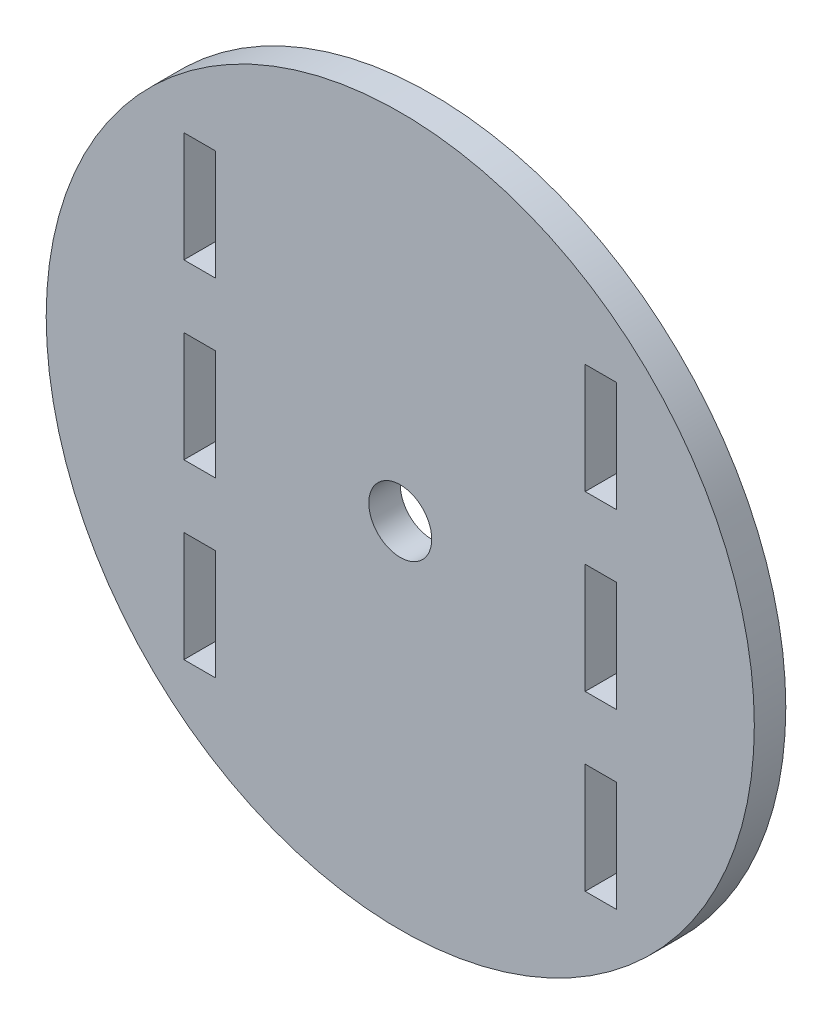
from build123d import *

# Parameters (mm, degrees)
SKETCH1_R           = 45
BOSS_EXTRUDE1_DEPTH = 4
SKETCH2_R           = 4
SKETCH2_W           = 4
SKETCH2_H           = 14
CUT_EXTRUDE3_DEPTH  = 35


with BuildPart() as part:
    # Sketch1 → Boss-Extrude1 (new body)
    with BuildSketch(Plane.XY):
        with Locations((45, 147.5080997)):
            Circle(SKETCH1_R)
    extrude(amount=BOSS_EXTRUDE1_DEPTH)

    # Sketch2 → Cut-Extrude3 (cut)
    with BuildSketch(Plane.XY):
        with Locations((45, 147.5080997)):
            Circle(SKETCH2_R)
        with Locations((70.5, 169.5080997)):
            Rectangle(SKETCH2_W, SKETCH2_H)
        with Locations((70.5, 147.5080997)):
            Rectangle(SKETCH2_W, SKETCH2_H)
        with Locations((70.5, 125.5080997)):
            Rectangle(SKETCH2_W, SKETCH2_H)
        with Locations((19.5, 169.5080997)):
            Rectangle(SKETCH2_W, SKETCH2_H)
        with Locations((19.5, 125.5080997)):
            Rectangle(SKETCH2_W, SKETCH2_H)
        with Locations((19.5, 147.5080997)):
            Rectangle(SKETCH2_W, SKETCH2_H)
    extrude(amount=CUT_EXTRUDE3_DEPTH, mode=Mode.SUBTRACT)


solid = part.part
